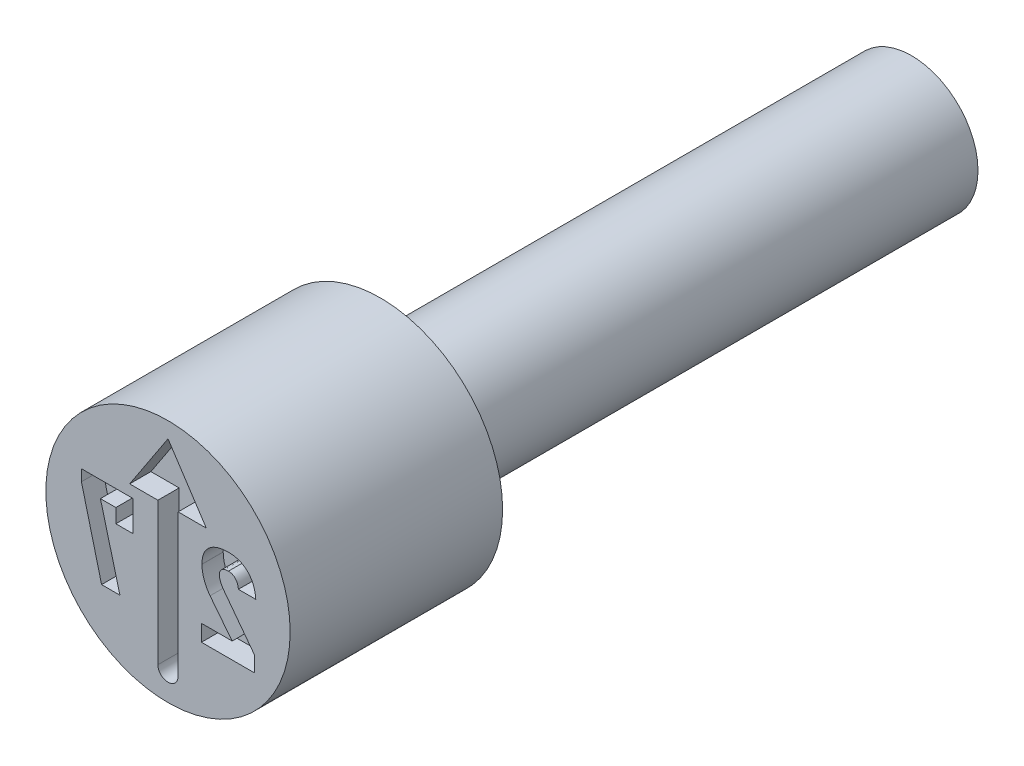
from build123d import *

# Parameters (mm, degrees)
CUT_EXTRUDE4_DEPTH = 0.4
CUT_EXTRUDE5_DEPTH = 0.4


with BuildPart() as part:
    # Sketch2 → Revolve1 (revolve)
    with BuildSketch(Plane(origin=(0, 0, 0), x_dir=(0, 0, -1), z_dir=(1, 0, 0)), mode=Mode.PRIVATE) as revolve1_sk:
        Polygon((0, 2.3), (0, 0), (14, 0), (14, 1.25), (4, 1.25), (4, 2.3), align=None)
    revolve(revolve1_sk.sketch.rotate(Axis((0, 0, -0.403888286), (0, 0, -1)), 90), axis=Axis((0, 0, -0.403888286), (0, 0, -1)))

    # Sketch3 → Cut-Extrude4 (cut)
    with BuildSketch(Plane.XY):
        with BuildLine():
            Line((0.190473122, 0.906351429), (0.190473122, -1.776161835))
            ThreePointArc((0.190473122, -1.776161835), (0, -1.966634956), (-0.190473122, -1.776161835))
            Line((-0.190473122, -1.776161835), (-0.190473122, 0.906351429))
            Line((-0.190473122, 0.906351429), (-0.721917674, 0.906351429))
            Line((-0.721917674, 0.906351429), (0, 2.002115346))
            Line((0, 2.002115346), (0.721917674, 0.906351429))
            Line((0.721917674, 0.906351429), (0.190473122, 0.906351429))
        make_face()
    extrude(amount=-CUT_EXTRUDE4_DEPTH, mode=Mode.SUBTRACT)

    # Sketch4 → Cut-Extrude5 (cut)
    with BuildSketch(Plane.XY):
        with BuildLine():
            Line((1.63114647, -1), (1.63114647, -0.710917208))
            Line((1.63114647, -0.710917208), (1.050221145, 0.058705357))
            add(Edge.make_bspline(
                [(1.050221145, 0.058705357), (1.038053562, 0.075850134), (1.014345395, 0.10925621), (0.992887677, 0.155132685), (0.979520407, 0.191100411), (0.973149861, 0.217184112), (0.968605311, 0.242070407), (0.968045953, 0.258422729), (0.967773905, 0.266375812)],
                knots=[0, 0, 0, 0, 1.664252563, 3.24274559, 3.998498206, 4.704056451, 5.369707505, 6, 6, 6, 6], degree=3))
            Line((0.967773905, 0.266375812), (0.967773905, 0.268790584))
            add(Edge.make_bspline(
                [(0.967773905, 0.268790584), (0.968245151, 0.279660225), (0.969147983, 0.300484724), (0.977654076, 0.329826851), (0.991595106, 0.355379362), (1.011562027, 0.376485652), (1.036419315, 0.393179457), (1.06616175, 0.404944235), (1.100400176, 0.411690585), (1.124702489, 0.41253986), (1.137497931, 0.412987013)],
                knots=[0, 0, 0, 0, 1.029992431, 1.973301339, 2.872554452, 3.768620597, 4.704316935, 5.693697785, 6.785705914, 8, 8, 8, 8], degree=3))
            add(Edge.make_bspline(
                [(1.137497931, 0.412987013), (1.149995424, 0.412499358), (1.174278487, 0.411551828), (1.208655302, 0.401050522), (1.239632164, 0.38457846), (1.26633668, 0.361074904), (1.288450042, 0.331565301), (1.306397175, 0.296815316), (1.318586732, 0.256197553), (1.322898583, 0.227121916), (1.325160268, 0.211870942)],
                knots=[0, 0, 0, 0, 0.980828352, 1.905783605, 2.800718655, 3.724477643, 4.680224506, 5.688112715, 6.78735127, 8, 8, 8, 8], degree=3))
            Line((1.325160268, 0.211870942), (1.325160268, 0.210836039))
            Line((1.325160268, 0.210836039), (1.652189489, 0.210836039))
            Line((1.652189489, 0.210836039), (1.652189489, 0.211870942))
            add(Edge.make_bspline(
                [(1.652189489, 0.211870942), (1.650575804, 0.231576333), (1.647425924, 0.270040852), (1.637099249, 0.325681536), (1.623752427, 0.378091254), (1.606773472, 0.427259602), (1.584955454, 0.472617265), (1.560442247, 0.515112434), (1.530959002, 0.553430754), (1.498685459, 0.588854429), (1.462738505, 0.620055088), (1.424409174, 0.647578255), (1.383117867, 0.67048199), (1.339492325, 0.689481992), (1.293048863, 0.703902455), (1.244394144, 0.714704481), (1.192969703, 0.720934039), (1.157867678, 0.721690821), (1.139912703, 0.722077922)],
                knots=[0, 0, 0, 0, 1.173229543, 2.290119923, 3.354877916, 4.382703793, 5.372196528, 6.339367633, 7.289741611, 8.236749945, 9.180232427, 10.11040526, 11.033485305, 11.978374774, 12.930610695, 13.916256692, 14.93414813, 16, 16, 16, 16], degree=3))
            add(Edge.make_bspline(
                [(1.139912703, 0.722077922), (1.120578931, 0.721803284), (1.082977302, 0.721269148), (1.028235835, 0.71550332), (0.976729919, 0.706801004), (0.928542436, 0.694069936), (0.883866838, 0.677463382), (0.842569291, 0.657439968), (0.804563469, 0.633829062), (0.770140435, 0.606580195), (0.739168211, 0.576188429), (0.712509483, 0.542345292), (0.689431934, 0.505734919), (0.671392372, 0.465647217), (0.656540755, 0.423024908), (0.646924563, 0.377103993), (0.640444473, 0.328425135), (0.639730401, 0.294915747), (0.639364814, 0.27775974)],
                knots=[0, 0, 0, 0, 1.219700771, 2.37215663, 3.469774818, 4.513610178, 5.512457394, 6.473141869, 7.405450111, 8.330272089, 9.238546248, 10.1372905, 11.043445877, 11.962355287, 12.905558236, 13.886315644, 14.917844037, 16, 16, 16, 16], degree=3))
            Line((0.639364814, 0.27775974), (0.639364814, 0.27637987))
            add(Edge.make_bspline(
                [(0.639364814, 0.27637987), (0.639804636, 0.257037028), (0.640685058, 0.218317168), (0.648632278, 0.160367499), (0.661439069, 0.102713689), (0.679027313, 0.045634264), (0.700876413, -0.009882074), (0.727099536, -0.063075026), (0.756695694, -0.113968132), (0.780147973, -0.14537873), (0.791840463, -0.161038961)],
                knots=[0, 0, 0, 0, 0.984368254, 1.970475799, 2.971844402, 3.988480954, 5.008197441, 6.005725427, 7.005724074, 8, 8, 8, 8], degree=3))
            Line((0.791840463, -0.161038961), (1.208561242, -0.690909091))
            Line((1.208561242, -0.690909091), (0.63005069, -0.690909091))
            Line((0.63005069, -0.690909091), (0.63005069, -1))
            Line((0.63005069, -1), (1.63114647, -1))
        make_face()
        Polygon((-1.629969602, 0.7), (-1.629969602, 0.486810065), (-1.250505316, -1), (-0.904847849, -1), (-1.272583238, 0.390909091), (-0.981775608, 0.390909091), (-0.981775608, 0.125974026), (-0.662680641, 0.125974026), (-0.662680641, 0.7), align=None)
    extrude(amount=-CUT_EXTRUDE5_DEPTH, mode=Mode.SUBTRACT)


solid = part.part
